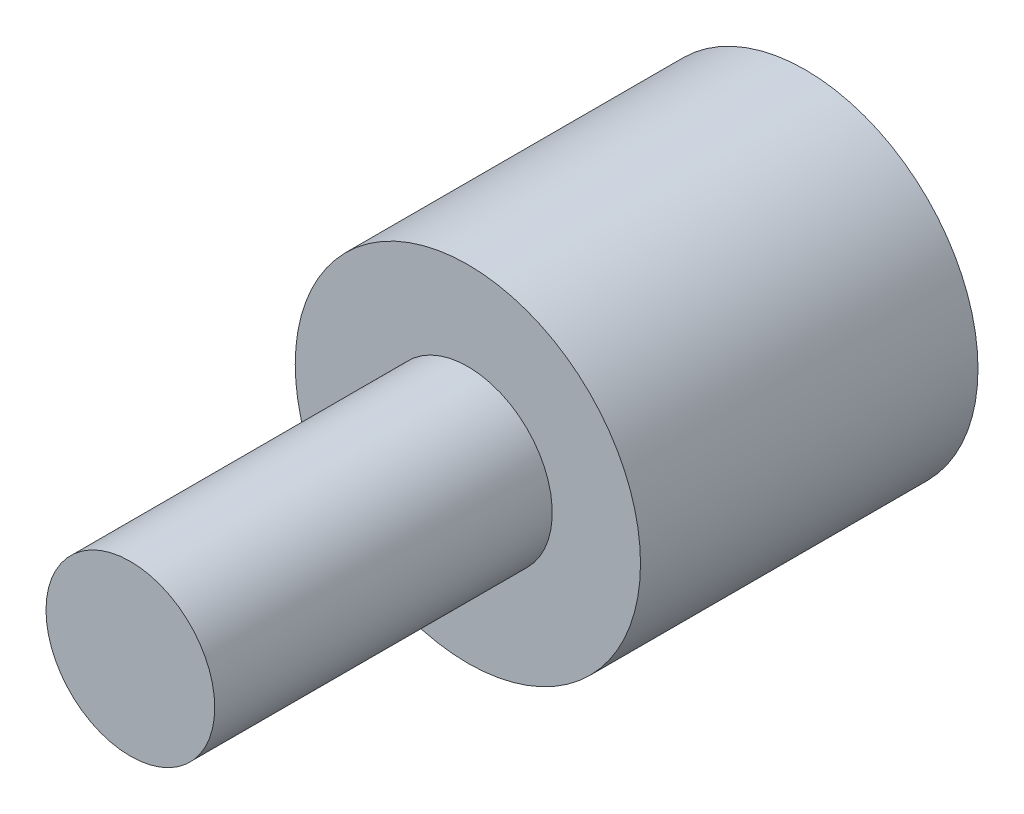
from build123d import *

# Parameters (mm, degrees)
SKIZZE1_R               = 2.5
LINEAR_AUSTRAGEN1_DEPTH = 10
SKIZZE2_R               = 5.115252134
LINEAR_AUSTRAGEN2_DEPTH = 10


with BuildPart() as part:
    # Skizze1 → Linear austragen1 (new body)
    with BuildSketch(Plane.XY):
        Circle(SKIZZE1_R)
    extrude(amount=LINEAR_AUSTRAGEN1_DEPTH)

    # Skizze2 → Linear austragen2 (add)
    with BuildSketch(Plane(origin=(0, 0, 0), x_dir=(-1, 0, 0), z_dir=(0, 0, -1))):
        Circle(SKIZZE2_R)
    extrude(amount=LINEAR_AUSTRAGEN2_DEPTH)


solid = part.part
